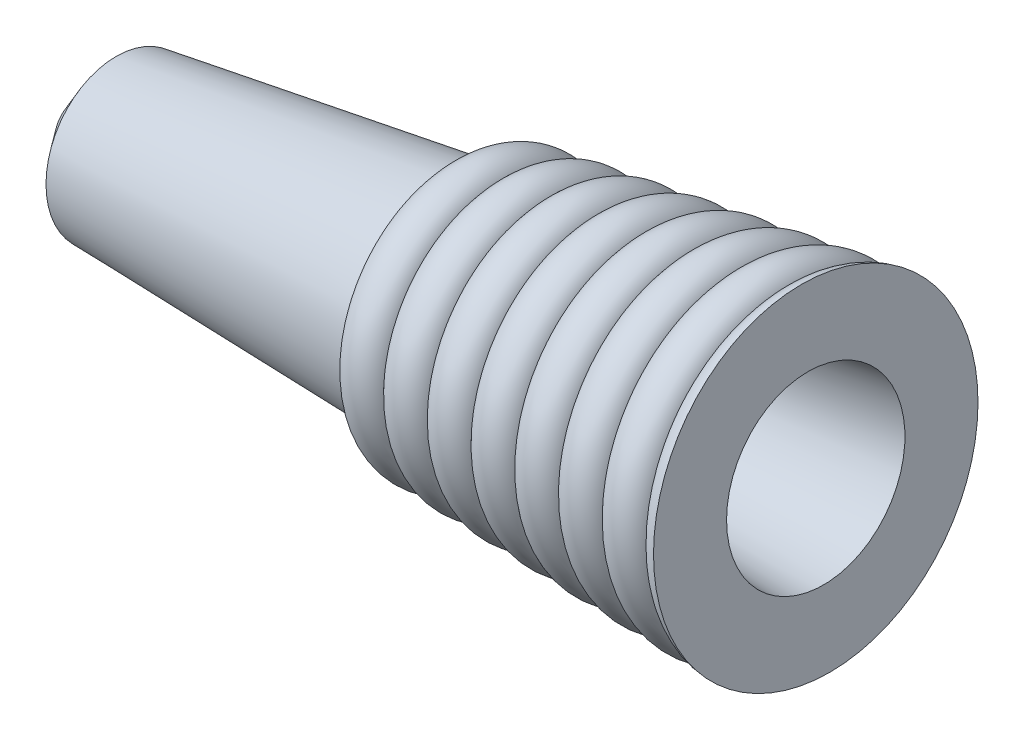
from build123d import *


with BuildPart() as part:
    # Sketch1 → Revolve2 (revolve)
    with BuildSketch(Plane.XY):
        with BuildLine():
            Line((0, 0), (6.35, -6.35))
            Line((6.35, -6.35), (50.8, -6.35))
            ThreePointArc((50.8, -6.35), (53.975, -9.525), (57.15, -6.35))
            ThreePointArc((57.15, -6.35), (60.325, -9.525), (63.5, -6.35))
            ThreePointArc((63.5, -6.35), (66.675, -9.525), (69.85, -6.35))
            ThreePointArc((69.85, -6.35), (73.025, -9.525), (76.2, -6.35))
            ThreePointArc((76.2, -6.35), (79.375, -9.525), (82.55, -6.35))
            ThreePointArc((82.55, -6.35), (85.725, -9.525), (88.9, -6.35))
            ThreePointArc((88.9, -6.35), (92.075, -9.525), (95.25, -6.35))
            ThreePointArc((95.25, -6.35), (98.425, -9.525), (101.6, -6.35))
            ThreePointArc((101.6, -6.35), (104.775, -9.525), (107.95, -6.35))
            ThreePointArc((107.95, -6.35), (111.125, -9.525), (114.3, -6.35))
            ThreePointArc((114.3, -6.35), (117.475, -9.525), (120.65, -6.35))
            ThreePointArc((120.65, -6.35), (123.825, -9.525), (127, -6.35))
            ThreePointArc((127, -6.35), (130.175, -9.525), (133.35, -6.35))
            ThreePointArc((133.35, -6.35), (136.525, -9.525), (139.7, -6.35))
            ThreePointArc((139.7, -6.35), (142.875, -9.525), (146.05, -6.35))
            ThreePointArc((146.05, -6.35), (149.225, -9.525), (152.4, -6.35))
            ThreePointArc((152.4, -6.35), (155.575, -9.525), (158.75, -6.35))
            ThreePointArc((158.75, -6.35), (161.925, -9.525), (165.1, -6.35))
            ThreePointArc((165.1, -6.35), (168.275, -9.525), (171.45, -6.35))
            ThreePointArc((171.45, -6.35), (174.625, -9.525), (177.8, -6.35))
            ThreePointArc((177.8, -6.35), (180.975, -9.525), (184.15, -6.35))
            ThreePointArc((184.15, -6.35), (187.325, -9.525), (190.5, -6.35))
            ThreePointArc((190.5, -6.35), (193.675, -9.525), (196.85, -6.35))
            ThreePointArc((196.85, -6.35), (200.025, -9.525), (203.2, -6.35))
            Line((203.2, -6.35), (292.1, -6.35))
            Line((292.1, -6.35), (304.8, -1.111106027))
            Line((304.8, -1.111106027), (292.1, 0))
            Line((292.1, 0), (259.461664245, 0))
            Line((259.461664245, 0), (265.811664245, 6.35))
            Line((265.811664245, 6.35), (262.636664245, 6.35))
            Line((262.636664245, 6.35), (256.286664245, 0))
            Line((256.286664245, 0), (243.586664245, 0))
            Line((243.586664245, 0), (249.936664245, 6.35))
            Line((249.936664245, 6.35), (246.761664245, 6.35))
            Line((246.761664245, 6.35), (240.411664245, 0))
            Line((240.411664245, 0), (227.711664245, 0))
            Line((227.711664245, 0), (234.061664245, 6.35))
            Line((234.061664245, 6.35), (230.886664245, 6.35))
            Line((230.886664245, 6.35), (224.536664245, 0))
            Line((224.536664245, 0), (211.836664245, 0))
            Line((211.836664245, 0), (218.186664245, 6.35))
            Line((218.186664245, 6.35), (215.011664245, 6.35))
            Line((215.011664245, 6.35), (208.661664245, 0))
            Line((208.661664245, 0), (195.961664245, 0))
            Line((195.961664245, 0), (202.311664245, 6.35))
            Line((202.311664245, 6.35), (199.136664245, 6.35))
            Line((199.136664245, 6.35), (192.786664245, 0))
            Line((192.786664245, 0), (180.086664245, 0))
            Line((180.086664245, 0), (186.436664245, 6.35))
            Line((186.436664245, 6.35), (183.261664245, 6.35))
            Line((183.261664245, 6.35), (176.911664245, 0))
            Line((176.911664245, 0), (164.211664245, 0))
            Line((164.211664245, 0), (170.561664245, 6.35))
            Line((170.561664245, 6.35), (167.386664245, 6.35))
            Line((167.386664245, 6.35), (161.036664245, 0))
            Line((161.036664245, 0), (148.336664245, 0))
            Line((148.336664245, 0), (154.686664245, 6.35))
            Line((154.686664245, 6.35), (151.511664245, 6.35))
            Line((151.511664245, 6.35), (145.161664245, 0))
            Line((145.161664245, 0), (132.461664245, 0))
            Line((132.461664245, 0), (138.811664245, 6.35))
            Line((138.811664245, 6.35), (135.636664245, 6.35))
            Line((135.636664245, 6.35), (129.286664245, 0))
            Line((129.286664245, 0), (116.586664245, 0))
            Line((116.586664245, 0), (122.936664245, 6.35))
            Line((122.936664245, 6.35), (119.761664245, 6.35))
            Line((119.761664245, 6.35), (113.411664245, 0))
            Line((113.411664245, 0), (100.711664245, 0))
            Line((100.711664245, 0), (107.061664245, 6.35))
            Line((107.061664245, 6.35), (103.886664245, 6.35))
            Line((103.886664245, 6.35), (97.536664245, 0))
            Line((97.536664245, 0), (0, 0))
        make_face()
    revolve(axis=Axis((29.791985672, 5.793588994, 0), (0.9961946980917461, 0.08715574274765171, 0)))

    # SurfaceCut3
    split(bisect_by=Plane(origin=(96.795763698, 8.468532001, 0), x_dir=(0, 0, -1), z_dir=(0.9961946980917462, 0.08715574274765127, 0)), keep=Keep.BOTTOM)


solid = part.part
